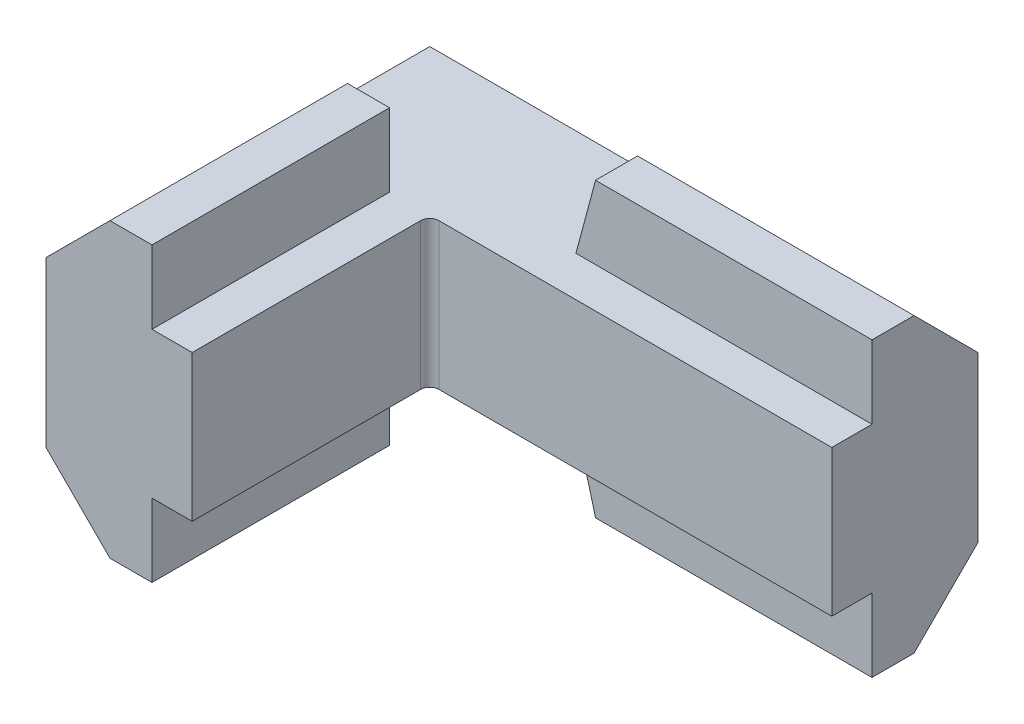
ISO-10303-21;
HEADER;
FILE_DESCRIPTION(('STEP AP214'),'2;1');
FILE_NAME('part.step','',(''),(''),'','','');
FILE_SCHEMA(('AUTOMOTIVE_DESIGN { 1 0 10303 214 1 1 1 1 }'));
ENDSEC;
DATA;
#1=APPLICATION_CONTEXT('core data for automotive mechanical design processes');
#2=APPLICATION_PROTOCOL_DEFINITION('international standard','automotive_design',2000,#1);
#3=PRODUCT_CONTEXT('',#1,'mechanical');
#4=PRODUCT('Part','Part','',(#3));
#5=PRODUCT_RELATED_PRODUCT_CATEGORY('part','',(#4));
#6=PRODUCT_DEFINITION_FORMATION('','',#4);
#7=PRODUCT_DEFINITION_CONTEXT('part definition',#1,'design');
#8=PRODUCT_DEFINITION('design','',#6,#7);
#9=PRODUCT_DEFINITION_SHAPE('','',#8);
#10=(LENGTH_UNIT() NAMED_UNIT(*) SI_UNIT(.MILLI.,.METRE.));
#11=(NAMED_UNIT(*) PLANE_ANGLE_UNIT() SI_UNIT($,.RADIAN.));
#12=(NAMED_UNIT(*) SI_UNIT($,.STERADIAN.) SOLID_ANGLE_UNIT());
#13=UNCERTAINTY_MEASURE_WITH_UNIT(LENGTH_MEASURE(1.E-05),#10,'distance_accuracy_value','');
#14=(GEOMETRIC_REPRESENTATION_CONTEXT(3) GLOBAL_UNCERTAINTY_ASSIGNED_CONTEXT((#13)) GLOBAL_UNIT_ASSIGNED_CONTEXT((#10,
#11,#12)) REPRESENTATION_CONTEXT('',''));
#15=CARTESIAN_POINT('',(0.,0.,0.));
#16=DIRECTION('',(0.,0.,1.));
#17=DIRECTION('',(1.,0.,0.));
#18=AXIS2_PLACEMENT_3D('',#15,#16,#17);
#19=CARTESIAN_POINT('',(-4.61499999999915,8.00000000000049,13.65));
#20=DIRECTION('',(1.068035E-13,1.,0.));
#21=DIRECTION('',(-1.,1.068035E-13,0.));
#22=AXIS2_PLACEMENT_3D('',#19,#20,#21);
#23=PLANE('',#22);
#24=DIRECTION('',(0.,0.,1.));
#25=VECTOR('',#24,1.);
#26=CARTESIAN_POINT('',(-2.19999999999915,8.00000000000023,13.65));
#27=LINE('',#26,#25);
#28=CARTESIAN_POINT('',(-2.19999999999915,8.00000000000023,0.));
#29=VERTEX_POINT('',#28);
#30=CARTESIAN_POINT('',(-2.19999999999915,8.0000000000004,13.));
#31=VERTEX_POINT('',#30);
#32=EDGE_CURVE('E255',#29,#31,#27,.T.);
#33=ORIENTED_EDGE('',*,*,#32,.F.);
#34=DIRECTION('',(1.,0.,0.));
#35=VECTOR('',#34,1.);
#36=CARTESIAN_POINT('',(-1.90999999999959,8.00000000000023,0.));
#37=LINE('',#36,#35);
#38=CARTESIAN_POINT('',(-4.49999999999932,8.00000000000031,0.));
#39=VERTEX_POINT('',#38);
#40=EDGE_CURVE('E294',#29,#39,#37,.F.);
#41=ORIENTED_EDGE('',*,*,#40,.T.);
#42=DIRECTION('',(0.,0.,1.));
#43=VECTOR('',#42,1.);
#44=CARTESIAN_POINT('',(-4.49999999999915,8.00000000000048,13.65));
#45=LINE('',#44,#43);
#46=CARTESIAN_POINT('',(-4.49999999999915,8.00000000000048,13.));
#47=VERTEX_POINT('',#46);
#48=EDGE_CURVE('E324',#47,#39,#45,.F.);
#49=ORIENTED_EDGE('',*,*,#48,.F.);
#50=DIRECTION('',(-1.,0.,0.));
#51=VECTOR('',#50,1.);
#52=CARTESIAN_POINT('',(-8.40000000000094,8.00000000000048,13.));
#53=LINE('',#52,#51);
#54=EDGE_CURVE('E243',#47,#31,#53,.F.);
#55=ORIENTED_EDGE('',*,*,#54,.T.);
#56=EDGE_LOOP('',(#33,#41,#49,#55));
#57=FACE_BOUND('',#56,.T.);
#58=ADVANCED_FACE('F16',(#57),#23,.T.);
#59=CARTESIAN_POINT('',(-2.08500000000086,-7.99999999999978,13.65));
#60=DIRECTION('',(-1.068035E-13,-1.,0.));
#61=DIRECTION('',(1.,-1.068035E-13,0.));
#62=AXIS2_PLACEMENT_3D('',#59,#60,#61);
#63=PLANE('',#62);
#64=DIRECTION('',(0.,0.,1.));
#65=VECTOR('',#64,1.);
#66=CARTESIAN_POINT('',(-4.50000000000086,-7.99999999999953,13.65));
#67=LINE('',#66,#65);
#68=CARTESIAN_POINT('',(-4.50000000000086,-7.99999999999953,0.));
#69=VERTEX_POINT('',#68);
#70=CARTESIAN_POINT('',(-4.5000000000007,-7.99999999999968,13.));
#71=VERTEX_POINT('',#70);
#72=EDGE_CURVE('E325',#69,#71,#67,.T.);
#73=ORIENTED_EDGE('',*,*,#72,.F.);
#74=DIRECTION('',(1.,0.,0.));
#75=VECTOR('',#74,1.);
#76=CARTESIAN_POINT('',(-1.91000000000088,-7.99999999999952,0.));
#77=LINE('',#76,#75);
#78=CARTESIAN_POINT('',(-2.20000000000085,-7.99999999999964,0.));
#79=VERTEX_POINT('',#78);
#80=EDGE_CURVE('E364',#69,#79,#77,.T.);
#81=ORIENTED_EDGE('',*,*,#80,.T.);
#82=DIRECTION('',(0.,0.,1.));
#83=VECTOR('',#82,1.);
#84=CARTESIAN_POINT('',(-2.20000000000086,-7.99999999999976,13.65));
#85=LINE('',#84,#83);
#86=CARTESIAN_POINT('',(-2.20000000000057,-7.99999999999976,13.));
#87=VERTEX_POINT('',#86);
#88=EDGE_CURVE('E405',#87,#79,#85,.F.);
#89=ORIENTED_EDGE('',*,*,#88,.F.);
#90=DIRECTION('',(-1.,0.,0.));
#91=VECTOR('',#90,1.);
#92=CARTESIAN_POINT('',(-8.40000000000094,-7.99999999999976,13.));
#93=LINE('',#92,#91);
#94=EDGE_CURVE('E313',#87,#71,#93,.T.);
#95=ORIENTED_EDGE('',*,*,#94,.T.);
#96=EDGE_LOOP('',(#73,#81,#89,#95));
#97=FACE_BOUND('',#96,.T.);
#98=ADVANCED_FACE('F708',(#97),#63,.T.);
#99=CARTESIAN_POINT('',(0.500000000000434,4.06441055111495,0.5));
#100=DIRECTION('',(1.068035E-13,1.,0.));
#101=DIRECTION('',(-1.,1.068035E-13,0.));
#102=AXIS2_PLACEMENT_3D('',#99,#100,#101);
#103=CYLINDRICAL_SURFACE('',#102,0.5);
#104=DIRECTION('',(0.,1.,0.));
#105=VECTOR('',#104,1.);
#106=CARTESIAN_POINT('',(0.500000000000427,-4.40000000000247,0.));
#107=LINE('',#106,#105);
#108=CARTESIAN_POINT('',(0.500000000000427,3.99999999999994,0.));
#109=VERTEX_POINT('',#108);
#110=CARTESIAN_POINT('',(0.5,-4.00000000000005,0.));
#111=VERTEX_POINT('',#110);
#112=EDGE_CURVE('E198',#109,#111,#107,.F.);
#113=ORIENTED_EDGE('',*,*,#112,.F.);
#114=CARTESIAN_POINT('',(0.500000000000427,3.99999999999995,0.5));
#115=DIRECTION('',(1.068035E-13,1.,0.));
#116=DIRECTION('',(-1.,1.068035E-13,0.));
#117=AXIS2_PLACEMENT_3D('',#114,#115,#116);
#118=CIRCLE('',#117,0.5);
#119=CARTESIAN_POINT('',(4.26852327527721E-13,4.,0.5));
#120=VERTEX_POINT('',#119);
#121=EDGE_CURVE('E19',#120,#109,#118,.F.);
#122=ORIENTED_EDGE('',*,*,#121,.F.);
#123=DIRECTION('',(1.068035E-13,1.,0.));
#124=VECTOR('',#123,1.);
#125=CARTESIAN_POINT('',(4.6990478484E-13,4.4,0.5));
#126=LINE('',#125,#124);
#127=CARTESIAN_POINT('',(-4.26867635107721E-13,-4.,0.5));
#128=VERTEX_POINT('',#127);
#129=EDGE_CURVE('E218',#128,#120,#126,.T.);
#130=ORIENTED_EDGE('',*,*,#129,.F.);
#131=CARTESIAN_POINT('',(0.499999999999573,-4.00000000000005,0.5));
#132=DIRECTION('',(1.068035E-13,1.,0.));
#133=DIRECTION('',(-1.,1.068035E-13,0.));
#134=AXIS2_PLACEMENT_3D('',#131,#132,#133);
#135=CIRCLE('',#134,0.5);
#136=EDGE_CURVE('E408',#111,#128,#135,.T.);
#137=ORIENTED_EDGE('',*,*,#136,.F.);
#138=EDGE_LOOP('',(#113,#122,#130,#137));
#139=FACE_BOUND('',#138,.T.);
#140=ADVANCED_FACE('F466',(#139),#103,.F.);
#141=CARTESIAN_POINT('',(-4.49999999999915,8.00000000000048,13.));
#142=DIRECTION('',(1.068035E-13,1.,0.));
#143=DIRECTION('',(-1.,1.068035E-13,0.));
#144=AXIS2_PLACEMENT_3D('',#141,#142,#143);
#145=PLANE('',#144);
#146=DIRECTION('',(1.,0.,0.));
#147=VECTOR('',#146,1.);
#148=CARTESIAN_POINT('',(22.8033012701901,7.99999999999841,-4.49999999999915));
#149=LINE('',#148,#147);
#150=CARTESIAN_POINT('',(6.87179676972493,7.99999999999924,-4.5));
#151=VERTEX_POINT('',#150);
#152=CARTESIAN_POINT('',(22.0000000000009,7.99999999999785,-4.4999999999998));
#153=VERTEX_POINT('',#152);
#154=EDGE_CURVE('E181',#151,#153,#149,.T.);
#155=ORIENTED_EDGE('',*,*,#154,.F.);
#156=DIRECTION('',(0.,0.,1.));
#157=VECTOR('',#156,1.);
#158=CARTESIAN_POINT('',(6.8717967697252,7.99999999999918,-8.29));
#159=LINE('',#158,#157);
#160=CARTESIAN_POINT('',(6.87179676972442,7.99999999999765,-2.2));
#161=VERTEX_POINT('',#160);
#162=EDGE_CURVE('E279',#151,#161,#159,.T.);
#163=ORIENTED_EDGE('',*,*,#162,.T.);
#164=DIRECTION('',(1.,0.,0.));
#165=VECTOR('',#164,1.);
#166=CARTESIAN_POINT('',(22.8100000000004,7.99999999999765,-2.2));
#167=LINE('',#166,#165);
#168=CARTESIAN_POINT('',(22.0000000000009,7.99999999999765,-2.2));
#169=VERTEX_POINT('',#168);
#170=EDGE_CURVE('E184',#169,#161,#167,.F.);
#171=ORIENTED_EDGE('',*,*,#170,.F.);
#172=DIRECTION('',(0.,0.,1.));
#173=VECTOR('',#172,1.);
#174=CARTESIAN_POINT('',(22.0000000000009,7.99999999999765,0.400000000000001));
#175=LINE('',#174,#173);
#176=EDGE_CURVE('E178',#169,#153,#175,.F.);
#177=ORIENTED_EDGE('',*,*,#176,.T.);
#178=EDGE_LOOP('',(#155,#163,#171,#177));
#179=FACE_BOUND('',#178,.T.);
#180=ADVANCED_FACE('F180',(#179),#145,.T.);
#181=CARTESIAN_POINT('',(22.7564101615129,-8.00000000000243,-2.085));
#182=DIRECTION('',(-1.068035E-13,-1.,0.));
#183=DIRECTION('',(1.,-1.068035E-13,0.));
#184=AXIS2_PLACEMENT_3D('',#181,#182,#183);
#185=PLANE('',#184);
#186=DIRECTION('',(1.,0.,0.));
#187=VECTOR('',#186,1.);
#188=CARTESIAN_POINT('',(22.8099999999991,-8.00000000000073,-2.2));
#189=LINE('',#188,#187);
#190=CARTESIAN_POINT('',(6.8717967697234,-8.00000000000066,-2.2));
#191=VERTEX_POINT('',#190);
#192=CARTESIAN_POINT('',(21.9999999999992,-8.00000000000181,-2.2));
#193=VERTEX_POINT('',#192);
#194=EDGE_CURVE('E353',#191,#193,#189,.T.);
#195=ORIENTED_EDGE('',*,*,#194,.F.);
#196=DIRECTION('',(0.,0.,1.));
#197=VECTOR('',#196,1.);
#198=CARTESIAN_POINT('',(6.87179676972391,-8.00000000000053,-8.29));
#199=LINE('',#198,#197);
#200=CARTESIAN_POINT('',(6.87179676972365,-8.00000000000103,-4.49999999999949));
#201=VERTEX_POINT('',#200);
#202=EDGE_CURVE('E363',#191,#201,#199,.F.);
#203=ORIENTED_EDGE('',*,*,#202,.T.);
#204=DIRECTION('',(1.,0.,0.));
#205=VECTOR('',#204,1.);
#206=CARTESIAN_POINT('',(22.8033012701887,-8.00000000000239,-4.50000000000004));
#207=LINE('',#206,#205);
#208=CARTESIAN_POINT('',(21.9999999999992,-8.00000000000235,-4.5));
#209=VERTEX_POINT('',#208);
#210=EDGE_CURVE('E208',#209,#201,#207,.F.);
#211=ORIENTED_EDGE('',*,*,#210,.F.);
#212=DIRECTION('',(0.,0.,1.));
#213=VECTOR('',#212,1.);
#214=CARTESIAN_POINT('',(21.9999999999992,-8.00000000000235,0.400000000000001));
#215=LINE('',#214,#213);
#216=EDGE_CURVE('E214',#209,#193,#215,.T.);
#217=ORIENTED_EDGE('',*,*,#216,.T.);
#218=EDGE_LOOP('',(#195,#203,#211,#217));
#219=FACE_BOUND('',#218,.T.);
#220=ADVANCED_FACE('F681',(#219),#185,.T.);
#221=CARTESIAN_POINT('',(-2.20000000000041,-3.79999999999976,13.65));
#222=DIRECTION('',(1.,-1.068035E-13,0.));
#223=DIRECTION('',(1.068035E-13,1.,0.));
#224=AXIS2_PLACEMENT_3D('',#221,#222,#223);
#225=PLANE('',#224);
#226=ORIENTED_EDGE('',*,*,#88,.T.);
#227=DIRECTION('',(0.,1.,0.));
#228=VECTOR('',#227,1.);
#229=CARTESIAN_POINT('',(-2.20000000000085,-8.1999999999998,0.));
#230=LINE('',#229,#228);
#231=CARTESIAN_POINT('',(-2.20000000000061,-3.99999999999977,0.));
#232=VERTEX_POINT('',#231);
#233=EDGE_CURVE('E407',#79,#232,#230,.T.);
#234=ORIENTED_EDGE('',*,*,#233,.T.);
#235=DIRECTION('',(0.,0.,1.));
#236=VECTOR('',#235,1.);
#237=CARTESIAN_POINT('',(-2.20000000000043,-3.99999999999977,14.05));
#238=LINE('',#237,#236);
#239=CARTESIAN_POINT('',(-2.20000000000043,-3.99999999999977,13.));
#240=VERTEX_POINT('',#239);
#241=EDGE_CURVE('E331',#240,#232,#238,.F.);
#242=ORIENTED_EDGE('',*,*,#241,.F.);
#243=DIRECTION('',(0.,1.,0.));
#244=VECTOR('',#243,1.);
#245=CARTESIAN_POINT('',(-2.20000000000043,-8.7999999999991,13.));
#246=LINE('',#245,#244);
#247=EDGE_CURVE('E242',#240,#87,#246,.F.);
#248=ORIENTED_EDGE('',*,*,#247,.T.);
#249=EDGE_LOOP('',(#226,#234,#242,#248));
#250=FACE_BOUND('',#249,.T.);
#251=ADVANCED_FACE('F671',(#250),#225,.T.);
#252=CARTESIAN_POINT('',(-1.91000000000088,-8.1999999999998,0.));
#253=DIRECTION('',(0.,0.,1.));
#254=DIRECTION('',(1.,0.,0.));
#255=AXIS2_PLACEMENT_3D('',#252,#253,#254);
#256=PLANE('',#255);
#257=DIRECTION('',(0.707106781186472,-0.707106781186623,0.));
#258=VECTOR('',#257,1.);
#259=CARTESIAN_POINT('',(-4.32500000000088,-8.17499999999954,0.));
#260=LINE('',#259,#258);
#261=CARTESIAN_POINT('',(-8.00000000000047,-4.49999999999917,0.));
#262=VERTEX_POINT('',#261);
#263=EDGE_CURVE('E321',#262,#69,#260,.T.);
#264=ORIENTED_EDGE('',*,*,#263,.F.);
#265=DIRECTION('',(0.,1.,0.));
#266=VECTOR('',#265,1.);
#267=CARTESIAN_POINT('',(-8.00000000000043,-8.1999999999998,0.));
#268=LINE('',#267,#266);
#269=CARTESIAN_POINT('',(-8.00000000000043,-3.99999999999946,0.));
#270=VERTEX_POINT('',#269);
#271=EDGE_CURVE('E431',#270,#262,#268,.F.);
#272=ORIENTED_EDGE('',*,*,#271,.F.);
#273=DIRECTION('',(1.,-1.068035E-13,0.));
#274=VECTOR('',#273,1.);
#275=CARTESIAN_POINT('',(23.4999999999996,-4.00000000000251,0.));
#276=LINE('',#275,#274);
#277=EDGE_CURVE('E358',#232,#270,#276,.F.);
#278=ORIENTED_EDGE('',*,*,#277,.F.);
#279=ORIENTED_EDGE('',*,*,#233,.F.);
#280=ORIENTED_EDGE('',*,*,#80,.F.);
#281=EDGE_LOOP('',(#264,#272,#278,#279,#280));
#282=FACE_BOUND('',#281,.T.);
#283=ADVANCED_FACE('F662',(#282),#256,.F.);
#284=CARTESIAN_POINT('',(6.92538660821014,-8.20000000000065,-8.29));
#285=DIRECTION('',(0.965925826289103,0.25881904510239,0.));
#286=DIRECTION('',(-0.25881904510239,0.965925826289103,0.));
#287=AXIS2_PLACEMENT_3D('',#284,#285,#286);
#288=PLANE('',#287);
#289=ORIENTED_EDGE('',*,*,#202,.F.);
#290=DIRECTION('',(0.258819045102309,-0.965925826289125,0.));
#291=VECTOR('',#290,1.);
#292=CARTESIAN_POINT('',(5.79999999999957,-4.00000000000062,-2.2));
#293=LINE('',#292,#291);
#294=CARTESIAN_POINT('',(5.79999999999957,-4.00000000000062,-2.2));
#295=VERTEX_POINT('',#294);
#296=EDGE_CURVE('E350',#295,#191,#293,.T.);
#297=ORIENTED_EDGE('',*,*,#296,.F.);
#298=DIRECTION('',(0.,0.,1.));
#299=VECTOR('',#298,1.);
#300=CARTESIAN_POINT('',(5.79999999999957,-4.00000000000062,14.05));
#301=LINE('',#300,#299);
#302=CARTESIAN_POINT('',(5.79999999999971,-4.00000000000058,-8.));
#303=VERTEX_POINT('',#302);
#304=EDGE_CURVE('E347',#303,#295,#301,.T.);
#305=ORIENTED_EDGE('',*,*,#304,.F.);
#306=DIRECTION('',(-0.25881904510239,0.965925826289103,0.));
#307=VECTOR('',#306,1.);
#308=CARTESIAN_POINT('',(6.92538660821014,-8.20000000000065,-8.));
#309=LINE('',#308,#307);
#310=CARTESIAN_POINT('',(5.93397459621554,-4.50000000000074,-7.99999999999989));
#311=VERTEX_POINT('',#310);
#312=EDGE_CURVE('E361',#311,#303,#309,.T.);
#313=ORIENTED_EDGE('',*,*,#312,.F.);
#314=DIRECTION('',(-0.186156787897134,0.694746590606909,-0.69474659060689));
#315=VECTOR('',#314,1.);
#316=CARTESIAN_POINT('',(6.87179676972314,-8.00000000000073,-4.5));
#317=LINE('',#316,#315);
#318=EDGE_CURVE('E332',#201,#311,#317,.T.);
#319=ORIENTED_EDGE('',*,*,#318,.F.);
#320=EDGE_LOOP('',(#289,#297,#305,#313,#319));
#321=FACE_BOUND('',#320,.T.);
#322=ADVANCED_FACE('F494',(#321),#288,.F.);
#323=CARTESIAN_POINT('',(22.8099999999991,-8.20000000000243,-2.2));
#324=DIRECTION('',(0.,0.,1.));
#325=DIRECTION('',(1.,0.,0.));
#326=AXIS2_PLACEMENT_3D('',#323,#324,#325);
#327=PLANE('',#326);
#328=DIRECTION('',(1.,-1.068035E-13,0.));
#329=VECTOR('',#328,1.);
#330=CARTESIAN_POINT('',(23.4999999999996,-4.00000000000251,-2.2));
#331=LINE('',#330,#329);
#332=CARTESIAN_POINT('',(21.9999999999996,-4.00000000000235,-2.2));
#333=VERTEX_POINT('',#332);
#334=EDGE_CURVE('E339',#295,#333,#331,.T.);
#335=ORIENTED_EDGE('',*,*,#334,.F.);
#336=ORIENTED_EDGE('',*,*,#296,.T.);
#337=ORIENTED_EDGE('',*,*,#194,.T.);
#338=DIRECTION('',(-1.068035E-13,-1.,0.));
#339=VECTOR('',#338,1.);
#340=CARTESIAN_POINT('',(21.9999999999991,-8.80000000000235,-2.2));
#341=LINE('',#340,#339);
#342=EDGE_CURVE('E282',#193,#333,#341,.F.);
#343=ORIENTED_EDGE('',*,*,#342,.T.);
#344=EDGE_LOOP('',(#335,#336,#337,#343));
#345=FACE_BOUND('',#344,.T.);
#346=ADVANCED_FACE('F643',(#345),#327,.T.);
#347=CARTESIAN_POINT('',(-4.32500000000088,-8.17499999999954,13.65));
#348=DIRECTION('',(-0.707106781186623,-0.707106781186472,0.));
#349=DIRECTION('',(0.707106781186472,-0.707106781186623,0.));
#350=AXIS2_PLACEMENT_3D('',#347,#348,#349);
#351=PLANE('',#350);
#352=DIRECTION('',(0.,0.,1.));
#353=VECTOR('',#352,1.);
#354=CARTESIAN_POINT('',(-8.00000000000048,-4.49999999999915,14.05));
#355=LINE('',#354,#353);
#356=CARTESIAN_POINT('',(-8.00000000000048,-4.49999999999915,13.));
#357=VERTEX_POINT('',#356);
#358=EDGE_CURVE('E305',#262,#357,#355,.T.);
#359=ORIENTED_EDGE('',*,*,#358,.F.);
#360=ORIENTED_EDGE('',*,*,#263,.T.);
#361=ORIENTED_EDGE('',*,*,#72,.T.);
#362=DIRECTION('',(-0.707106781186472,0.707106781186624,0.));
#363=VECTOR('',#362,1.);
#364=CARTESIAN_POINT('',(-4.50000000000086,-7.99999999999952,13.));
#365=LINE('',#364,#363);
#366=EDGE_CURVE('E230',#71,#357,#365,.T.);
#367=ORIENTED_EDGE('',*,*,#366,.T.);
#368=EDGE_LOOP('',(#359,#360,#361,#367));
#369=FACE_BOUND('',#368,.T.);
#370=ADVANCED_FACE('F633',(#369),#351,.T.);
#371=CARTESIAN_POINT('',(-8.17499999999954,4.32500000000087,13.65));
#372=DIRECTION('',(-0.707106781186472,0.707106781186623,0.));
#373=DIRECTION('',(-0.707106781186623,-0.707106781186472,0.));
#374=AXIS2_PLACEMENT_3D('',#371,#372,#373);
#375=PLANE('',#374);
#376=ORIENTED_EDGE('',*,*,#48,.T.);
#377=DIRECTION('',(-0.707106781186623,-0.707106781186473,0.));
#378=VECTOR('',#377,1.);
#379=CARTESIAN_POINT('',(-4.49999999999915,8.00000000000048,0.));
#380=LINE('',#379,#378);
#381=CARTESIAN_POINT('',(-7.99999999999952,4.50000000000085,0.));
#382=VERTEX_POINT('',#381);
#383=EDGE_CURVE('E292',#39,#382,#380,.T.);
#384=ORIENTED_EDGE('',*,*,#383,.T.);
#385=DIRECTION('',(0.,0.,1.));
#386=VECTOR('',#385,1.);
#387=CARTESIAN_POINT('',(-7.99999999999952,4.50000000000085,14.05));
#388=LINE('',#387,#386);
#389=CARTESIAN_POINT('',(-7.99999999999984,4.50000000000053,13.));
#390=VERTEX_POINT('',#389);
#391=EDGE_CURVE('E268',#390,#382,#388,.F.);
#392=ORIENTED_EDGE('',*,*,#391,.F.);
#393=DIRECTION('',(0.707106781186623,0.707106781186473,0.));
#394=VECTOR('',#393,1.);
#395=CARTESIAN_POINT('',(-7.99999999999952,4.50000000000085,13.));
#396=LINE('',#395,#394);
#397=EDGE_CURVE('E254',#390,#47,#396,.T.);
#398=ORIENTED_EDGE('',*,*,#397,.T.);
#399=EDGE_LOOP('',(#376,#384,#392,#398));
#400=FACE_BOUND('',#399,.T.);
#401=ADVANCED_FACE('F623',(#400),#375,.T.);
#402=CARTESIAN_POINT('',(22.8100000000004,3.79999999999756,-2.2));
#403=DIRECTION('',(0.,0.,1.));
#404=DIRECTION('',(1.,0.,0.));
#405=AXIS2_PLACEMENT_3D('',#402,#403,#404);
#406=PLANE('',#405);
#407=ORIENTED_EDGE('',*,*,#170,.T.);
#408=DIRECTION('',(0.258819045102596,0.965925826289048,0.));
#409=VECTOR('',#408,1.);
#410=CARTESIAN_POINT('',(5.74641016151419,3.79999999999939,-2.2));
#411=LINE('',#410,#409);
#412=CARTESIAN_POINT('',(5.80000000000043,3.99999999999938,-2.2));
#413=VERTEX_POINT('',#412);
#414=EDGE_CURVE('E295',#161,#413,#411,.F.);
#415=ORIENTED_EDGE('',*,*,#414,.T.);
#416=DIRECTION('',(-1.,1.068035E-13,0.));
#417=VECTOR('',#416,1.);
#418=CARTESIAN_POINT('',(-9.49999999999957,4.00000000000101,-2.2));
#419=LINE('',#418,#417);
#420=CARTESIAN_POINT('',(22.0000000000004,3.99999999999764,-2.2));
#421=VERTEX_POINT('',#420);
#422=EDGE_CURVE('E222',#421,#413,#419,.T.);
#423=ORIENTED_EDGE('',*,*,#422,.F.);
#424=DIRECTION('',(-1.068035E-13,-1.,0.));
#425=VECTOR('',#424,1.);
#426=CARTESIAN_POINT('',(21.9999999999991,-8.80000000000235,-2.2));
#427=LINE('',#426,#425);
#428=EDGE_CURVE('E189',#421,#169,#427,.F.);
#429=ORIENTED_EDGE('',*,*,#428,.T.);
#430=EDGE_LOOP('',(#407,#415,#423,#429));
#431=FACE_BOUND('',#430,.T.);
#432=ADVANCED_FACE('F614',(#431),#406,.T.);
#433=CARTESIAN_POINT('',(5.74641016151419,3.79999999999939,-8.29));
#434=DIRECTION('',(0.965925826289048,-0.258819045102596,0.));
#435=DIRECTION('',(0.258819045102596,0.965925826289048,0.));
#436=AXIS2_PLACEMENT_3D('',#433,#434,#435);
#437=PLANE('',#436);
#438=ORIENTED_EDGE('',*,*,#414,.F.);
#439=ORIENTED_EDGE('',*,*,#162,.F.);
#440=DIRECTION('',(0.186156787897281,0.69474659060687,0.69474659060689));
#441=VECTOR('',#440,1.);
#442=CARTESIAN_POINT('',(5.93397459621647,4.49999999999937,-8.));
#443=LINE('',#442,#441);
#444=CARTESIAN_POINT('',(5.93397459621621,4.49999999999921,-8.00000000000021));
#445=VERTEX_POINT('',#444);
#446=EDGE_CURVE('E197',#445,#151,#443,.T.);
#447=ORIENTED_EDGE('',*,*,#446,.F.);
#448=DIRECTION('',(0.258819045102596,0.965925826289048,0.));
#449=VECTOR('',#448,1.);
#450=CARTESIAN_POINT('',(5.74641016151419,3.79999999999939,-8.));
#451=LINE('',#450,#449);
#452=CARTESIAN_POINT('',(5.80000000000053,3.99999999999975,-8.));
#453=VERTEX_POINT('',#452);
#454=EDGE_CURVE('E166',#453,#445,#451,.T.);
#455=ORIENTED_EDGE('',*,*,#454,.F.);
#456=DIRECTION('',(0.,0.,1.));
#457=VECTOR('',#456,1.);
#458=CARTESIAN_POINT('',(5.80000000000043,3.99999999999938,14.05));
#459=LINE('',#458,#457);
#460=EDGE_CURVE('E263',#413,#453,#459,.F.);
#461=ORIENTED_EDGE('',*,*,#460,.F.);
#462=EDGE_LOOP('',(#438,#439,#447,#455,#461));
#463=FACE_BOUND('',#462,.T.);
#464=ADVANCED_FACE('F604',(#463),#437,.F.);
#465=CARTESIAN_POINT('',(-1.90999999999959,3.8000000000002,0.));
#466=DIRECTION('',(0.,0.,1.));
#467=DIRECTION('',(1.,0.,0.));
#468=AXIS2_PLACEMENT_3D('',#465,#466,#467);
#469=PLANE('',#468);
#470=DIRECTION('',(1.068035E-13,1.,0.));
#471=VECTOR('',#470,1.);
#472=CARTESIAN_POINT('',(-2.19999999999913,8.20000000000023,0.));
#473=LINE('',#472,#471);
#474=CARTESIAN_POINT('',(-2.19999999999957,4.00000000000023,0.));
#475=VERTEX_POINT('',#474);
#476=EDGE_CURVE('E251',#475,#29,#473,.T.);
#477=ORIENTED_EDGE('',*,*,#476,.F.);
#478=DIRECTION('',(-1.,1.068035E-13,0.));
#479=VECTOR('',#478,1.);
#480=CARTESIAN_POINT('',(-9.49999999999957,4.00000000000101,0.));
#481=LINE('',#480,#479);
#482=CARTESIAN_POINT('',(-7.99999999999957,4.00000000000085,0.));
#483=VERTEX_POINT('',#482);
#484=EDGE_CURVE('E248',#483,#475,#481,.F.);
#485=ORIENTED_EDGE('',*,*,#484,.F.);
#486=DIRECTION('',(-1.068035E-13,-1.,0.));
#487=VECTOR('',#486,1.);
#488=CARTESIAN_POINT('',(-8.00000000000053,-4.94999999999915,0.));
#489=LINE('',#488,#487);
#490=EDGE_CURVE('E266',#382,#483,#489,.T.);
#491=ORIENTED_EDGE('',*,*,#490,.F.);
#492=ORIENTED_EDGE('',*,*,#383,.F.);
#493=ORIENTED_EDGE('',*,*,#40,.F.);
#494=EDGE_LOOP('',(#477,#485,#491,#492,#493));
#495=FACE_BOUND('',#494,.T.);
#496=ADVANCED_FACE('F594',(#495),#469,.F.);
#497=CARTESIAN_POINT('',(-2.19999999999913,8.20000000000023,13.65));
#498=DIRECTION('',(1.,-1.068035E-13,0.));
#499=DIRECTION('',(1.068035E-13,1.,0.));
#500=AXIS2_PLACEMENT_3D('',#497,#498,#499);
#501=PLANE('',#500);
#502=DIRECTION('',(0.,0.,1.));
#503=VECTOR('',#502,1.);
#504=CARTESIAN_POINT('',(-2.19999999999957,4.00000000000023,14.05));
#505=LINE('',#504,#503);
#506=CARTESIAN_POINT('',(-2.19999999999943,4.00000000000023,13.));
#507=VERTEX_POINT('',#506);
#508=EDGE_CURVE('E237',#475,#507,#505,.T.);
#509=ORIENTED_EDGE('',*,*,#508,.F.);
#510=ORIENTED_EDGE('',*,*,#476,.T.);
#511=ORIENTED_EDGE('',*,*,#32,.T.);
#512=DIRECTION('',(0.,1.,0.));
#513=VECTOR('',#512,1.);
#514=CARTESIAN_POINT('',(-2.19999999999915,-8.7999999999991,13.));
#515=LINE('',#514,#513);
#516=EDGE_CURVE('E240',#31,#507,#515,.F.);
#517=ORIENTED_EDGE('',*,*,#516,.T.);
#518=EDGE_LOOP('',(#509,#510,#511,#517));
#519=FACE_BOUND('',#518,.T.);
#520=ADVANCED_FACE('F584',(#519),#501,.T.);
#521=CARTESIAN_POINT('',(-8.40000000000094,-8.7999999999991,13.));
#522=DIRECTION('',(0.,0.,-1.));
#523=DIRECTION('',(-1.,0.,0.));
#524=AXIS2_PLACEMENT_3D('',#521,#522,#523);
#525=PLANE('',#524);
#526=ORIENTED_EDGE('',*,*,#366,.F.);
#527=ORIENTED_EDGE('',*,*,#94,.F.);
#528=ORIENTED_EDGE('',*,*,#247,.F.);
#529=DIRECTION('',(1.,-1.068035E-13,0.));
#530=VECTOR('',#529,1.);
#531=CARTESIAN_POINT('',(23.4999999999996,-4.00000000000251,13.));
#532=LINE('',#531,#530);
#533=CARTESIAN_POINT('',(-4.2716464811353E-13,-4.,13.));
#534=VERTEX_POINT('',#533);
#535=EDGE_CURVE('E328',#534,#240,#532,.F.);
#536=ORIENTED_EDGE('',*,*,#535,.F.);
#537=DIRECTION('',(1.068035E-13,1.,0.));
#538=VECTOR('',#537,1.);
#539=CARTESIAN_POINT('',(4.6913940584E-13,4.4,13.));
#540=LINE('',#539,#538);
#541=CARTESIAN_POINT('',(4.26633985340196E-13,3.99999999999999,13.));
#542=VERTEX_POINT('',#541);
#543=EDGE_CURVE('E227',#542,#534,#540,.F.);
#544=ORIENTED_EDGE('',*,*,#543,.F.);
#545=DIRECTION('',(-1.,1.068035E-13,0.));
#546=VECTOR('',#545,1.);
#547=CARTESIAN_POINT('',(-9.49999999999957,4.00000000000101,13.));
#548=LINE('',#547,#546);
#549=EDGE_CURVE('E233',#507,#542,#548,.F.);
#550=ORIENTED_EDGE('',*,*,#549,.F.);
#551=ORIENTED_EDGE('',*,*,#516,.F.);
#552=ORIENTED_EDGE('',*,*,#54,.F.);
#553=ORIENTED_EDGE('',*,*,#397,.F.);
#554=DIRECTION('',(-1.068035E-13,-1.,0.));
#555=VECTOR('',#554,1.);
#556=CARTESIAN_POINT('',(-8.00000000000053,-4.94999999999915,13.));
#557=LINE('',#556,#555);
#558=EDGE_CURVE('E300',#357,#390,#557,.F.);
#559=ORIENTED_EDGE('',*,*,#558,.F.);
#560=EDGE_LOOP('',(#526,#527,#528,#536,#544,#550,#551,#552,#553,#559));
#561=FACE_BOUND('',#560,.T.);
#562=ADVANCED_FACE('F575',(#561),#525,.F.);
#563=CARTESIAN_POINT('',(4.6910113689E-13,4.4,13.625));
#564=DIRECTION('',(1.,-1.068035E-13,0.));
#565=DIRECTION('',(1.068035E-13,1.,0.));
#566=AXIS2_PLACEMENT_3D('',#563,#564,#565);
#567=PLANE('',#566);
#568=DIRECTION('',(0.,0.,1.));
#569=VECTOR('',#568,1.);
#570=CARTESIAN_POINT('',(-4.26741975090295E-13,-4.,14.05));
#571=LINE('',#570,#569);
#572=EDGE_CURVE('E318',#128,#534,#571,.T.);
#573=ORIENTED_EDGE('',*,*,#572,.F.);
#574=ORIENTED_EDGE('',*,*,#129,.T.);
#575=DIRECTION('',(0.,0.,1.));
#576=VECTOR('',#575,1.);
#577=CARTESIAN_POINT('',(4.26741975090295E-13,3.99999999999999,14.05));
#578=LINE('',#577,#576);
#579=EDGE_CURVE('E236',#542,#120,#578,.F.);
#580=ORIENTED_EDGE('',*,*,#579,.F.);
#581=ORIENTED_EDGE('',*,*,#543,.T.);
#582=EDGE_LOOP('',(#573,#574,#580,#581));
#583=FACE_BOUND('',#582,.T.);
#584=ADVANCED_FACE('F469',(#583),#567,.T.);
#585=CARTESIAN_POINT('',(23.0749999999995,-4.40000000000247,0.));
#586=DIRECTION('',(0.,0.,1.));
#587=DIRECTION('',(1.,0.,0.));
#588=AXIS2_PLACEMENT_3D('',#585,#586,#587);
#589=PLANE('',#588);
#590=DIRECTION('',(-1.,1.068035E-13,0.));
#591=VECTOR('',#590,1.);
#592=CARTESIAN_POINT('',(-9.49999999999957,4.00000000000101,0.));
#593=LINE('',#592,#591);
#594=CARTESIAN_POINT('',(22.0000000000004,3.99999999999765,0.));
#595=VERTEX_POINT('',#594);
#596=EDGE_CURVE('E478',#109,#595,#593,.F.);
#597=ORIENTED_EDGE('',*,*,#596,.F.);
#598=ORIENTED_EDGE('',*,*,#112,.T.);
#599=DIRECTION('',(1.,-1.068035E-13,0.));
#600=VECTOR('',#599,1.);
#601=CARTESIAN_POINT('',(23.4999999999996,-4.00000000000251,0.));
#602=LINE('',#601,#600);
#603=CARTESIAN_POINT('',(21.9999999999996,-4.00000000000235,0.));
#604=VERTEX_POINT('',#603);
#605=EDGE_CURVE('E338',#604,#111,#602,.F.);
#606=ORIENTED_EDGE('',*,*,#605,.F.);
#607=DIRECTION('',(-1.068035E-13,-1.,0.));
#608=VECTOR('',#607,1.);
#609=CARTESIAN_POINT('',(21.9999999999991,-8.80000000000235,0.));
#610=LINE('',#609,#608);
#611=EDGE_CURVE('E280',#604,#595,#610,.F.);
#612=ORIENTED_EDGE('',*,*,#611,.T.);
#613=EDGE_LOOP('',(#597,#598,#606,#612));
#614=FACE_BOUND('',#613,.T.);
#615=ADVANCED_FACE('F557',(#614),#589,.T.);
#616=CARTESIAN_POINT('',(22.8033012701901,8.17499999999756,-4.325));
#617=DIRECTION('',(0.,0.707106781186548,-0.707106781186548));
#618=DIRECTION('',(0.,0.707106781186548,0.707106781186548));
#619=AXIS2_PLACEMENT_3D('',#616,#617,#618);
#620=PLANE('',#619);
#621=DIRECTION('',(-1.,0.,0.));
#622=VECTOR('',#621,1.);
#623=CARTESIAN_POINT('',(-9.50000000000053,4.49999999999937,-8.));
#624=LINE('',#623,#622);
#625=CARTESIAN_POINT('',(22.0000000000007,4.49999999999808,-8.));
#626=VERTEX_POINT('',#625);
#627=EDGE_CURVE('E482',#445,#626,#624,.F.);
#628=ORIENTED_EDGE('',*,*,#627,.F.);
#629=ORIENTED_EDGE('',*,*,#446,.T.);
#630=ORIENTED_EDGE('',*,*,#154,.T.);
#631=DIRECTION('',(0.,-0.707106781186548,-0.707106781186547));
#632=VECTOR('',#631,1.);
#633=CARTESIAN_POINT('',(22.0000000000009,7.99999999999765,-4.5));
#634=LINE('',#633,#632);
#635=EDGE_CURVE('E188',#153,#626,#634,.T.);
#636=ORIENTED_EDGE('',*,*,#635,.T.);
#637=EDGE_LOOP('',(#628,#629,#630,#636));
#638=FACE_BOUND('',#637,.T.);
#639=ADVANCED_FACE('F195',(#638),#620,.T.);
#640=CARTESIAN_POINT('',(21.9999999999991,-8.80000000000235,0.400000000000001));
#641=DIRECTION('',(-1.,1.068035E-13,0.));
#642=DIRECTION('',(-1.068035E-13,-1.,0.));
#643=AXIS2_PLACEMENT_3D('',#640,#641,#642);
#644=PLANE('',#643);
#645=ORIENTED_EDGE('',*,*,#176,.F.);
#646=ORIENTED_EDGE('',*,*,#428,.F.);
#647=DIRECTION('',(0.,0.,1.));
#648=VECTOR('',#647,1.);
#649=CARTESIAN_POINT('',(22.0000000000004,3.99999999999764,14.05));
#650=LINE('',#649,#648);
#651=EDGE_CURVE('E219',#595,#421,#650,.F.);
#652=ORIENTED_EDGE('',*,*,#651,.F.);
#653=ORIENTED_EDGE('',*,*,#611,.F.);
#654=DIRECTION('',(0.,0.,1.));
#655=VECTOR('',#654,1.);
#656=CARTESIAN_POINT('',(21.9999999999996,-4.00000000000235,14.05));
#657=LINE('',#656,#655);
#658=EDGE_CURVE('E335',#333,#604,#657,.T.);
#659=ORIENTED_EDGE('',*,*,#658,.F.);
#660=ORIENTED_EDGE('',*,*,#342,.F.);
#661=ORIENTED_EDGE('',*,*,#216,.F.);
#662=DIRECTION('',(0.,0.707106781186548,-0.707106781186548));
#663=VECTOR('',#662,1.);
#664=CARTESIAN_POINT('',(21.9999999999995,-4.32500000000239,-8.17499999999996));
#665=LINE('',#664,#663);
#666=CARTESIAN_POINT('',(21.9999999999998,-4.50000000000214,-8.00000000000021));
#667=VERTEX_POINT('',#666);
#668=EDGE_CURVE('E205',#667,#209,#665,.F.);
#669=ORIENTED_EDGE('',*,*,#668,.F.);
#670=DIRECTION('',(0.,1.,0.));
#671=VECTOR('',#670,1.);
#672=CARTESIAN_POINT('',(22.0000000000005,-4.94999999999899,-8.));
#673=LINE('',#672,#671);
#674=EDGE_CURVE('E203',#626,#667,#673,.F.);
#675=ORIENTED_EDGE('',*,*,#674,.F.);
#676=ORIENTED_EDGE('',*,*,#635,.F.);
#677=EDGE_LOOP('',(#645,#646,#652,#653,#659,#660,#661,#669,#675,#676));
#678=FACE_BOUND('',#677,.T.);
#679=ADVANCED_FACE('F200',(#678),#644,.F.);
#680=CARTESIAN_POINT('',(22.8033012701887,-4.32500000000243,-8.175));
#681=DIRECTION('',(0.,-0.707106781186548,-0.707106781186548));
#682=DIRECTION('',(0.,0.707106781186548,-0.707106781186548));
#683=AXIS2_PLACEMENT_3D('',#680,#681,#682);
#684=PLANE('',#683);
#685=ORIENTED_EDGE('',*,*,#210,.T.);
#686=ORIENTED_EDGE('',*,*,#318,.T.);
#687=DIRECTION('',(-1.,0.,0.));
#688=VECTOR('',#687,1.);
#689=CARTESIAN_POINT('',(-9.50000000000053,-4.50000000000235,-8.));
#690=LINE('',#689,#688);
#691=EDGE_CURVE('E369',#667,#311,#690,.T.);
#692=ORIENTED_EDGE('',*,*,#691,.F.);
#693=ORIENTED_EDGE('',*,*,#668,.T.);
#694=EDGE_LOOP('',(#685,#686,#692,#693));
#695=FACE_BOUND('',#694,.T.);
#696=ADVANCED_FACE('F490',(#695),#684,.T.);
#697=CARTESIAN_POINT('',(23.4999999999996,-4.00000000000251,14.05));
#698=DIRECTION('',(-1.068035E-13,-1.,0.));
#699=DIRECTION('',(1.,-1.068035E-13,0.));
#700=AXIS2_PLACEMENT_3D('',#697,#698,#699);
#701=PLANE('',#700);
#702=ORIENTED_EDGE('',*,*,#136,.T.);
#703=ORIENTED_EDGE('',*,*,#572,.T.);
#704=ORIENTED_EDGE('',*,*,#535,.T.);
#705=ORIENTED_EDGE('',*,*,#241,.T.);
#706=ORIENTED_EDGE('',*,*,#277,.T.);
#707=DIRECTION('',(0.,0.,1.));
#708=VECTOR('',#707,1.);
#709=CARTESIAN_POINT('',(-8.00000000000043,-3.99999999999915,14.05));
#710=LINE('',#709,#708);
#711=CARTESIAN_POINT('',(-8.00000000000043,-3.99999999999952,-8.));
#712=VERTEX_POINT('',#711);
#713=EDGE_CURVE('E223',#712,#270,#710,.T.);
#714=ORIENTED_EDGE('',*,*,#713,.F.);
#715=DIRECTION('',(-1.,0.,0.));
#716=VECTOR('',#715,1.);
#717=CARTESIAN_POINT('',(-9.50000000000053,-4.00000000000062,-8.));
#718=LINE('',#717,#716);
#719=EDGE_CURVE('E275',#303,#712,#718,.T.);
#720=ORIENTED_EDGE('',*,*,#719,.F.);
#721=ORIENTED_EDGE('',*,*,#304,.T.);
#722=ORIENTED_EDGE('',*,*,#334,.T.);
#723=ORIENTED_EDGE('',*,*,#658,.T.);
#724=ORIENTED_EDGE('',*,*,#605,.T.);
#725=EDGE_LOOP('',(#702,#703,#704,#705,#706,#714,#720,#721,#722,#723,#724));
#726=FACE_BOUND('',#725,.T.);
#727=ADVANCED_FACE('F463',(#726),#701,.T.);
#728=CARTESIAN_POINT('',(-8.00000000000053,-4.94999999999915,14.05));
#729=DIRECTION('',(-1.,1.068035E-13,0.));
#730=DIRECTION('',(-1.068035E-13,-1.,0.));
#731=AXIS2_PLACEMENT_3D('',#728,#729,#730);
#732=PLANE('',#731);
#733=ORIENTED_EDGE('',*,*,#713,.T.);
#734=ORIENTED_EDGE('',*,*,#271,.T.);
#735=ORIENTED_EDGE('',*,*,#358,.T.);
#736=ORIENTED_EDGE('',*,*,#558,.T.);
#737=ORIENTED_EDGE('',*,*,#391,.T.);
#738=ORIENTED_EDGE('',*,*,#490,.T.);
#739=DIRECTION('',(0.,0.,1.));
#740=VECTOR('',#739,1.);
#741=CARTESIAN_POINT('',(-7.99999999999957,4.00000000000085,14.05));
#742=LINE('',#741,#740);
#743=CARTESIAN_POINT('',(-7.99999999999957,4.00000000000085,-8.));
#744=VERTEX_POINT('',#743);
#745=EDGE_CURVE('E34',#744,#483,#742,.T.);
#746=ORIENTED_EDGE('',*,*,#745,.F.);
#747=DIRECTION('',(0.,1.,0.));
#748=VECTOR('',#747,1.);
#749=CARTESIAN_POINT('',(-8.00000000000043,-4.94999999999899,-8.));
#750=LINE('',#749,#748);
#751=EDGE_CURVE('E25',#712,#744,#750,.T.);
#752=ORIENTED_EDGE('',*,*,#751,.F.);
#753=EDGE_LOOP('',(#733,#734,#735,#736,#737,#738,#746,#752));
#754=FACE_BOUND('',#753,.T.);
#755=ADVANCED_FACE('F498',(#754),#732,.T.);
#756=CARTESIAN_POINT('',(-9.49999999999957,4.00000000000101,14.05));
#757=DIRECTION('',(1.068035E-13,1.,0.));
#758=DIRECTION('',(-1.,1.068035E-13,0.));
#759=AXIS2_PLACEMENT_3D('',#756,#757,#758);
#760=PLANE('',#759);
#761=ORIENTED_EDGE('',*,*,#121,.T.);
#762=ORIENTED_EDGE('',*,*,#596,.T.);
#763=ORIENTED_EDGE('',*,*,#651,.T.);
#764=ORIENTED_EDGE('',*,*,#422,.T.);
#765=ORIENTED_EDGE('',*,*,#460,.T.);
#766=DIRECTION('',(-1.,0.,0.));
#767=VECTOR('',#766,1.);
#768=CARTESIAN_POINT('',(-9.50000000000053,4.00000000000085,-8.));
#769=LINE('',#768,#767);
#770=EDGE_CURVE('E10',#744,#453,#769,.F.);
#771=ORIENTED_EDGE('',*,*,#770,.F.);
#772=ORIENTED_EDGE('',*,*,#745,.T.);
#773=ORIENTED_EDGE('',*,*,#484,.T.);
#774=ORIENTED_EDGE('',*,*,#508,.T.);
#775=ORIENTED_EDGE('',*,*,#549,.T.);
#776=ORIENTED_EDGE('',*,*,#579,.T.);
#777=EDGE_LOOP('',(#761,#762,#763,#764,#765,#771,#772,#773,#774,#775,#776));
#778=FACE_BOUND('',#777,.T.);
#779=ADVANCED_FACE('F500',(#778),#760,.T.);
#780=CARTESIAN_POINT('',(-9.50000000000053,-4.94999999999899,-8.));
#781=DIRECTION('',(0.,0.,-1.));
#782=DIRECTION('',(-1.,0.,0.));
#783=AXIS2_PLACEMENT_3D('',#780,#781,#782);
#784=PLANE('',#783);
#785=ORIENTED_EDGE('',*,*,#751,.T.);
#786=ORIENTED_EDGE('',*,*,#770,.T.);
#787=ORIENTED_EDGE('',*,*,#454,.T.);
#788=ORIENTED_EDGE('',*,*,#627,.T.);
#789=ORIENTED_EDGE('',*,*,#674,.T.);
#790=ORIENTED_EDGE('',*,*,#691,.T.);
#791=ORIENTED_EDGE('',*,*,#312,.T.);
#792=ORIENTED_EDGE('',*,*,#719,.T.);
#793=EDGE_LOOP('',(#785,#786,#787,#788,#789,#790,#791,#792));
#794=FACE_BOUND('',#793,.T.);
#795=ADVANCED_FACE('F485',(#794),#784,.T.);
#796=CLOSED_SHELL('',(#58,#98,#140,#180,#220,#251,#283,#322,#346,#370,#401,#432,#464,#496,#520,
#562,#584,#615,#639,#679,#696,#727,#755,#779,#795));
#797=MANIFOLD_SOLID_BREP('B1',#796);
#798=ADVANCED_BREP_SHAPE_REPRESENTATION('',(#18,#797),#14);
#799=SHAPE_DEFINITION_REPRESENTATION(#9,#798);
ENDSEC;
END-ISO-10303-21;
